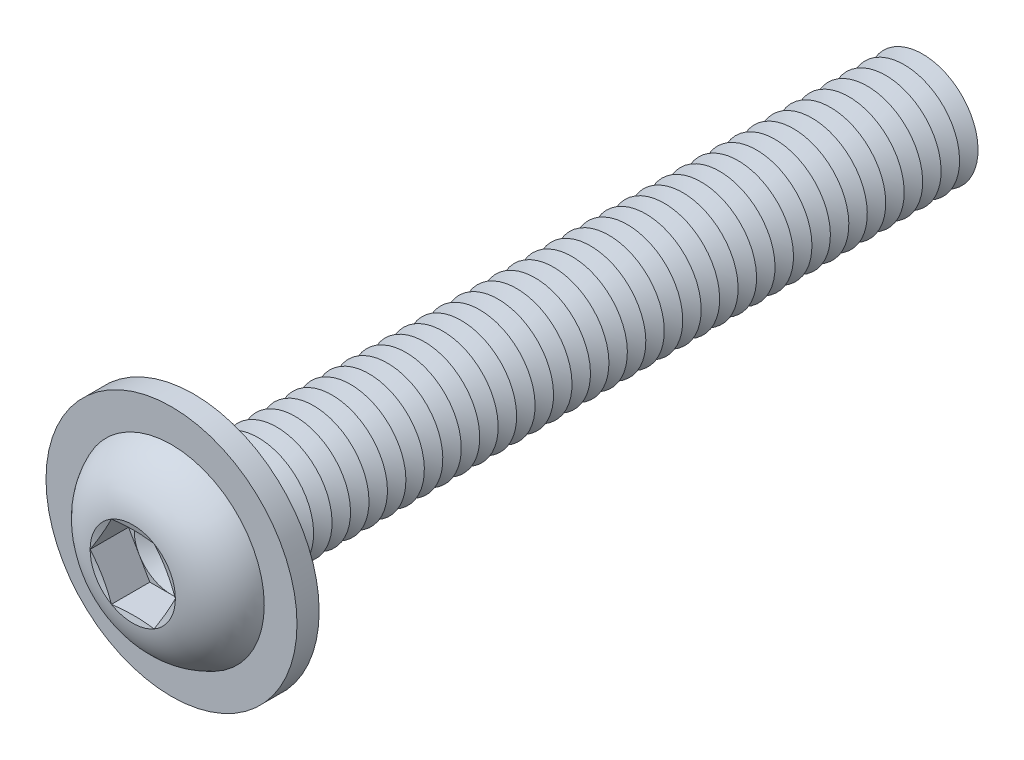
from build123d import *

# Parameters (mm, degrees)
FILLET1_R           = 0.5
LPATTERN1_COUNT     = 40
LPATTERN1_PITCH     = 1
CUT_EXTRUDE1_DEPTH  = 2.08
SKETCH5_R           = 6.8
SKETCH5_R_2         = 3.5
BOSS_EXTRUDE1_DEPTH = 1.2


with BuildPart() as part:
    # Sketch1 → Revolve1 (revolve)
    with BuildSketch(Plane(origin=(0, 0, 0), x_dir=(0, 0, -1), z_dir=(1, 0, 0))):
        with BuildLine():
            Line((0, 3), (0, 5.25))
            ThreePointArc((0, 5.25), (-2.210041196, 4.408189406), (-3.3, 2.3094))
            Line((-3.3, 2.3094), (-2.990599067, 1.1547))
            Line((-2.990599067, 1.1547), (-3.3, 1.1547))
            Line((-3.3, 1.1547), (-3.3, 0))
            Line((-3.3, 0), (40, 0))
            Line((40, 0), (40, 3))
            Line((40, 3), (0, 3))
        make_face()
    revolve(axis=Axis((0, 0, -40), (0, 0, 1)))

    # Fillet1
    fillet1_edges = [part.edges().sort_by_distance(p)[0] for p in [
        (0, -3, 0),
    ]]
    fillet(fillet1_edges, radius=FILLET1_R)

    # Sketch2 → Cut-Revolve1 (revolve, cut)
    with BuildSketch(Plane(origin=(0, 0, 0), x_dir=(0, 0, -1), z_dir=(1, 0, 0))):
        Polygon((39.5, 3), (40.5, 3), (40, 2.133974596), align=None)
    cut_revolve1 = revolve(axis=Axis((0, 0, -40), (0, 0, -1)), mode=Mode.SUBTRACT)

    # LPattern1: Cut-Revolve1 ×40
    with Locations(*[(0, 0, i * LPATTERN1_PITCH) for i in range(1, LPATTERN1_COUNT)]):
        add(cut_revolve1, mode=Mode.SUBTRACT)

    # Sketch3 → Cut-Extrude1 (cut)
    with BuildSketch(Plane.XY.offset(3.3)):
        Polygon((1.1547, 1.999999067), (-1.1547, 1.999999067), (-2.3094, 0), (-1.1547, -1.999999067), (1.1547, -1.999999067), (2.3094, 0), align=None)
    extrude(amount=-CUT_EXTRUDE1_DEPTH, mode=Mode.SUBTRACT)

    # Cut-Extrude2 cone 1 section (on through the dimple's axis) → Cut-Extrude2 (revolve, cut)
    with BuildSketch(Plane(origin=(0, 0, 1.22), x_dir=(0, -1, 0), z_dir=(1, 0, 0))):
        Polygon((0, 0), (1.999999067, 0), (0, 1.1547), align=None)
    revolve(axis=Axis((0, 0, 1.22), (0, 0, -1)), mode=Mode.SUBTRACT)

    # Sketch5 → Boss-Extrude1 (add)
    with BuildSketch(Plane(origin=(0, 0, 0), x_dir=(-1, 0, 0), z_dir=(0, 0, -1))):
        with Locations(Location((0, 0, 0), (0, 0, 90))):
            Circle(SKETCH5_R)
        Circle(SKETCH5_R_2, mode=Mode.SUBTRACT)
    extrude(amount=-BOSS_EXTRUDE1_DEPTH)


solid = part.part
